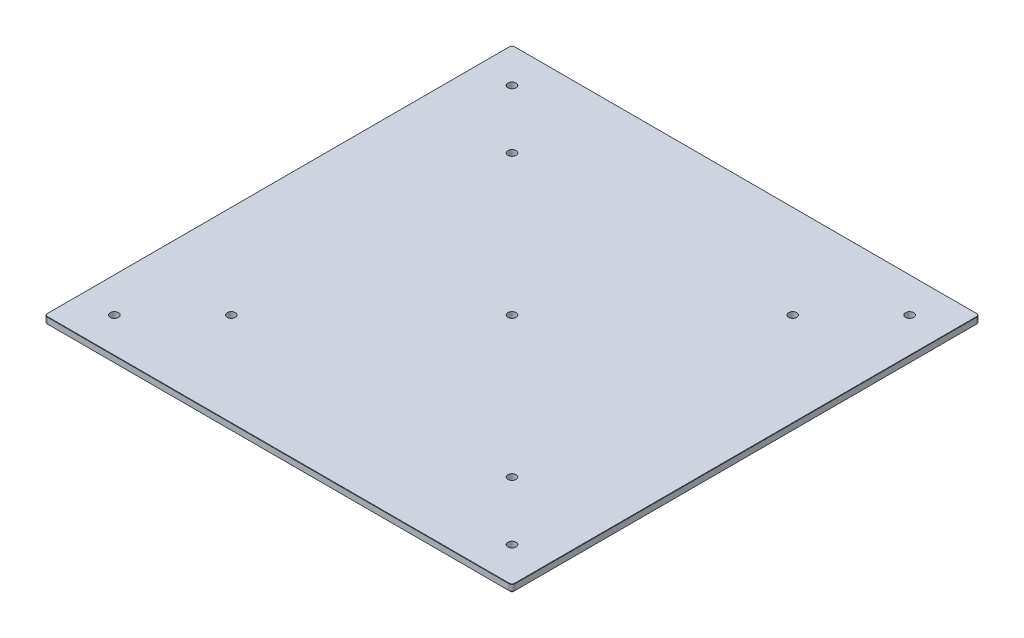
from build123d import *

# Parameters (mm, degrees)
SKETCH1_W               = 381
SKETCH1_H               = 381
BOSS_EXTRUDE1_DEPTH     = 6.35
FILLET1_R               = 2.54
CHAMFER1_SIZE           = 1.27
F_1_4_CLEARANCE_HOLE1_D = 6.7564
CHAMFER2_SIZE           = 0.254
F_1_4_CLEARANCE_HOLE2_D = 6.7564


with BuildPart() as part:
    # Sketch1 → Boss-Extrude1 (new body)
    with BuildSketch(Plane(origin=(0, 0, 0), x_dir=(1, 0, 0), z_dir=(0, 1, 0))):
        Rectangle(SKETCH1_W, SKETCH1_H)
    extrude(amount=-BOSS_EXTRUDE1_DEPTH)

    # Fillet1
    fillet1_edges = [part.edges().sort_by_distance(p)[0] for p in [
        (190.5, -3.175, 190.5),
        (-190.5, -3.175, 190.5),
        (-190.5, -3.175, -190.5),
        (190.5, -3.175, -190.5),
    ]]
    fillet(fillet1_edges, radius=FILLET1_R)

    # Chamfer1
    chamfer1_edges = [part.edges().sort_by_distance(p)[0] for p in [
        (0, -6.35, 190.5),
        (190.5, -6.35, 0),
        (-190.5, -6.35, 0),
        (0, -6.35, -190.5),
        (-189.756051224, -6.35, 189.756051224),
        (-189.756051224, -6.35, -189.756051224),
        (189.756051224, -6.35, -189.756051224),
        (189.756051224, -6.35, 189.756051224),
    ]]
    chamfer(chamfer1_edges, length=CHAMFER1_SIZE)

    # 1_4 Clearance Hole1 (through all)
    with Locations(Plane.XZ.offset(6.35)):
        with Locations((114.3, 114.3), (114.3, -114.3), (0, 0), (-114.3, 114.3), (-114.3, -114.3)):
            Hole(F_1_4_CLEARANCE_HOLE1_D / 2)

    # Chamfer2
    chamfer2_edges = [part.edges().sort_by_distance(p)[0] for p in [
        (0, 0, 190.5),
        (190.5, 0, 0),
        (0, 0, -190.5),
        (-190.5, 0, 0),
        (-189.756051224, 0, 189.756051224),
        (-189.756051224, 0, -189.756051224),
        (189.756051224, 0, -189.756051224),
        (189.756051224, 0, 189.756051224),
    ]]
    chamfer(chamfer2_edges, length=CHAMFER2_SIZE)

    # 1_4 Clearance Hole2 (through all)
    with Locations(Plane(origin=(0, 0, 0), x_dir=(-1, 0, 0), z_dir=(0, 1, 0))):
        with Locations((161.925, -161.925), (-161.925, -161.925), (-161.925, 161.925), (161.925, 161.925)):
            Hole(F_1_4_CLEARANCE_HOLE2_D / 2)


solid = part.part
